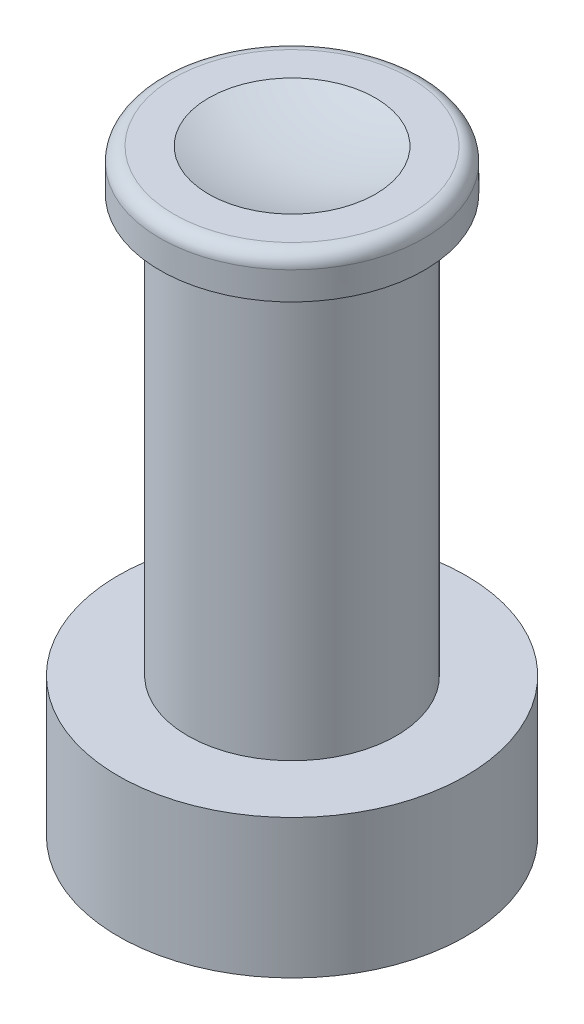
ISO-10303-21;
HEADER;
FILE_DESCRIPTION(('STEP AP214'),'2;1');
FILE_NAME('part.step','',(''),(''),'','','');
FILE_SCHEMA(('AUTOMOTIVE_DESIGN { 1 0 10303 214 1 1 1 1 }'));
ENDSEC;
DATA;
#1=APPLICATION_CONTEXT('core data for automotive mechanical design processes');
#2=APPLICATION_PROTOCOL_DEFINITION('international standard','automotive_design',2000,#1);
#3=PRODUCT_CONTEXT('',#1,'mechanical');
#4=PRODUCT('Part','Part','',(#3));
#5=PRODUCT_RELATED_PRODUCT_CATEGORY('part','',(#4));
#6=PRODUCT_DEFINITION_FORMATION('','',#4);
#7=PRODUCT_DEFINITION_CONTEXT('part definition',#1,'design');
#8=PRODUCT_DEFINITION('design','',#6,#7);
#9=PRODUCT_DEFINITION_SHAPE('','',#8);
#10=(LENGTH_UNIT() NAMED_UNIT(*) SI_UNIT(.MILLI.,.METRE.));
#11=(NAMED_UNIT(*) PLANE_ANGLE_UNIT() SI_UNIT($,.RADIAN.));
#12=(NAMED_UNIT(*) SI_UNIT($,.STERADIAN.) SOLID_ANGLE_UNIT());
#13=UNCERTAINTY_MEASURE_WITH_UNIT(LENGTH_MEASURE(1.E-05),#10,'distance_accuracy_value','');
#14=(GEOMETRIC_REPRESENTATION_CONTEXT(3) GLOBAL_UNCERTAINTY_ASSIGNED_CONTEXT((#13)) GLOBAL_UNIT_ASSIGNED_CONTEXT((#10,
#11,#12)) REPRESENTATION_CONTEXT('',''));
#15=CARTESIAN_POINT('',(0.,0.,0.));
#16=DIRECTION('',(0.,0.,1.));
#17=DIRECTION('',(1.,0.,0.));
#18=AXIS2_PLACEMENT_3D('',#15,#16,#17);
#19=CARTESIAN_POINT('',(0.,-7.62,0.));
#20=DIRECTION('',(0.,1.,0.));
#21=DIRECTION('',(0.,0.,1.));
#22=AXIS2_PLACEMENT_3D('',#19,#20,#21);
#23=CYLINDRICAL_SURFACE('',#22,1.905);
#24=CARTESIAN_POINT('',(0.,-7.62,0.));
#25=DIRECTION('',(0.,-1.,0.));
#26=DIRECTION('',(0.,0.,-1.));
#27=AXIS2_PLACEMENT_3D('',#24,#25,#26);
#28=CIRCLE('',#27,1.905);
#29=CARTESIAN_POINT('',(0.,-7.62,1.905));
#30=VERTEX_POINT('',#29);
#31=EDGE_CURVE('E51',#30,#30,#28,.F.);
#32=CARTESIAN_POINT('',(0.,0.,0.));
#33=DIRECTION('',(0.,1.,0.));
#34=DIRECTION('',(0.,0.,1.));
#35=AXIS2_PLACEMENT_3D('',#32,#33,#34);
#36=CIRCLE('',#35,1.905);
#37=CARTESIAN_POINT('',(0.,0.,1.905));
#38=VERTEX_POINT('',#37);
#39=EDGE_CURVE('E42',#38,#38,#36,.T.);
#40=CARTESIAN_POINT('',(0.,-7.62,1.905));
#41=CARTESIAN_POINT('',(0.,-7.540625,1.905));
#42=CARTESIAN_POINT('',(0.,-7.46125,1.905));
#43=CARTESIAN_POINT('',(0.,-7.3025,1.905));
#44=CARTESIAN_POINT('',(0.,-7.223125,1.905));
#45=CARTESIAN_POINT('',(0.,-7.064375,1.905));
#46=CARTESIAN_POINT('',(0.,-6.985,1.905));
#47=CARTESIAN_POINT('',(0.,-6.82625,1.905));
#48=CARTESIAN_POINT('',(0.,-6.746875,1.905));
#49=CARTESIAN_POINT('',(0.,-6.588125,1.905));
#50=CARTESIAN_POINT('',(0.,-6.50875,1.905));
#51=CARTESIAN_POINT('',(0.,-6.35,1.905));
#52=CARTESIAN_POINT('',(0.,-6.270625,1.905));
#53=CARTESIAN_POINT('',(0.,-6.111875,1.905));
#54=CARTESIAN_POINT('',(0.,-6.0325,1.905));
#55=CARTESIAN_POINT('',(0.,-5.87375,1.905));
#56=CARTESIAN_POINT('',(0.,-5.794375,1.905));
#57=CARTESIAN_POINT('',(0.,-5.635625,1.905));
#58=CARTESIAN_POINT('',(0.,-5.55625,1.905));
#59=CARTESIAN_POINT('',(0.,-5.3975,1.905));
#60=CARTESIAN_POINT('',(0.,-5.318125,1.905));
#61=CARTESIAN_POINT('',(0.,-5.159375,1.905));
#62=CARTESIAN_POINT('',(0.,-5.08,1.905));
#63=CARTESIAN_POINT('',(0.,-4.92125,1.905));
#64=CARTESIAN_POINT('',(0.,-4.841875,1.905));
#65=CARTESIAN_POINT('',(0.,-4.683125,1.905));
#66=CARTESIAN_POINT('',(0.,-4.60375,1.905));
#67=CARTESIAN_POINT('',(0.,-4.445,1.905));
#68=CARTESIAN_POINT('',(0.,-4.365625,1.905));
#69=CARTESIAN_POINT('',(0.,-4.206875,1.905));
#70=CARTESIAN_POINT('',(0.,-4.1275,1.905));
#71=CARTESIAN_POINT('',(0.,-3.96875,1.905));
#72=CARTESIAN_POINT('',(0.,-3.889375,1.905));
#73=CARTESIAN_POINT('',(0.,-3.730625,1.905));
#74=CARTESIAN_POINT('',(0.,-3.65125,1.905));
#75=CARTESIAN_POINT('',(0.,-3.4925,1.905));
#76=CARTESIAN_POINT('',(0.,-3.413125,1.905));
#77=CARTESIAN_POINT('',(0.,-3.254375,1.905));
#78=CARTESIAN_POINT('',(0.,-3.175,1.905));
#79=CARTESIAN_POINT('',(0.,-3.01625,1.905));
#80=CARTESIAN_POINT('',(0.,-2.936875,1.905));
#81=CARTESIAN_POINT('',(0.,-2.778125,1.905));
#82=CARTESIAN_POINT('',(0.,-2.69875,1.905));
#83=CARTESIAN_POINT('',(0.,-2.54,1.905));
#84=CARTESIAN_POINT('',(0.,-2.460625,1.905));
#85=CARTESIAN_POINT('',(0.,-2.301875,1.905));
#86=CARTESIAN_POINT('',(0.,-2.2225,1.905));
#87=CARTESIAN_POINT('',(0.,-2.06375,1.905));
#88=CARTESIAN_POINT('',(0.,-1.984375,1.905));
#89=CARTESIAN_POINT('',(0.,-1.825625,1.905));
#90=CARTESIAN_POINT('',(0.,-1.74625,1.905));
#91=CARTESIAN_POINT('',(0.,-1.5875,1.905));
#92=CARTESIAN_POINT('',(0.,-1.508125,1.905));
#93=CARTESIAN_POINT('',(0.,-1.349375,1.905));
#94=CARTESIAN_POINT('',(0.,-1.27,1.905));
#95=CARTESIAN_POINT('',(0.,-1.11125,1.905));
#96=CARTESIAN_POINT('',(0.,-1.031875,1.905));
#97=CARTESIAN_POINT('',(0.,-0.873125,1.905));
#98=CARTESIAN_POINT('',(0.,-0.79375,1.905));
#99=CARTESIAN_POINT('',(0.,-0.635,1.905));
#100=CARTESIAN_POINT('',(0.,-0.555625,1.905));
#101=CARTESIAN_POINT('',(0.,-0.396875,1.905));
#102=CARTESIAN_POINT('',(0.,-0.3175,1.905));
#103=CARTESIAN_POINT('',(0.,-0.15875,1.905));
#104=CARTESIAN_POINT('',(0.,-0.0793749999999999,1.905));
#105=CARTESIAN_POINT('',(0.,0.,1.905));
#106=B_SPLINE_CURVE_WITH_KNOTS('',3,(#40,#41,#42,#43,#44,#45,#46,#47,#48,#49,#50,#51,#52,#53,
#54,#55,#56,#57,#58,#59,#60,#61,#62,#63,#64,#65,#66,#67,#68,#69,#70,#71,#72,#73,#74,#75,#76,#77,
#78,#79,#80,#81,#82,#83,#84,#85,#86,#87,#88,#89,#90,#91,#92,#93,#94,#95,#96,#97,#98,#99,#100,
#101,#102,#103,#104,#105),.UNSPECIFIED.,.F.,.F.,(4,2,2,2,2,2,2,2,2,2,2,2,2,2,2,2,2,2,2,2,2,2,2,
2,2,2,2,2,2,2,2,2,4),(0.,0.238125,0.47625,0.714375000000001,0.9525,1.190625,1.42875,1.666875,
1.905,2.143125,2.38125,2.619375,2.8575,3.095625,3.33375,3.571875,3.81,4.048125,4.28625,4.524375,
4.7625,5.000625,5.23875,5.476875,5.715,5.953125,6.19125,6.429375,6.6675,6.905625,7.14375,
7.381875,7.62),.UNSPECIFIED.);
#107=EDGE_CURVE('BSEAM32',#30,#38,#106,.T.);
#108=ORIENTED_EDGE('',*,*,#31,.T.);
#109=ORIENTED_EDGE('',*,*,#39,.F.);
#110=ORIENTED_EDGE('',*,*,#107,.T.);
#111=ORIENTED_EDGE('',*,*,#107,.F.);
#112=EDGE_LOOP('',(#108,#110,#109,#111));
#113=FACE_BOUND('',#112,.T.);
#114=ADVANCED_FACE('F32',(#113),#23,.T.);
#115=CARTESIAN_POINT('',(0.,0.762,0.));
#116=DIRECTION('',(0.,-1.,0.));
#117=DIRECTION('',(0.,0.,-1.));
#118=AXIS2_PLACEMENT_3D('',#115,#116,#117);
#119=CYLINDRICAL_SURFACE('',#118,2.413);
#120=CARTESIAN_POINT('',(0.,0.508,0.));
#121=DIRECTION('',(0.,1.,0.));
#122=DIRECTION('',(0.,0.,1.));
#123=AXIS2_PLACEMENT_3D('',#120,#121,#122);
#124=CIRCLE('',#123,2.413);
#125=CARTESIAN_POINT('',(0.,0.508,-2.413));
#126=VERTEX_POINT('',#125);
#127=EDGE_CURVE('E10',#126,#126,#124,.F.);
#128=CARTESIAN_POINT('',(0.,0.,0.));
#129=DIRECTION('',(0.,1.,0.));
#130=DIRECTION('',(0.,0.,1.));
#131=AXIS2_PLACEMENT_3D('',#128,#129,#130);
#132=CIRCLE('',#131,2.413);
#133=CARTESIAN_POINT('',(0.,0.,-2.413));
#134=VERTEX_POINT('',#133);
#135=EDGE_CURVE('E46',#134,#134,#132,.T.);
#136=CARTESIAN_POINT('',(0.,0.508,-2.413));
#137=CARTESIAN_POINT('',(0.,0.502708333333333,-2.413));
#138=CARTESIAN_POINT('',(0.,0.497416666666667,-2.413));
#139=CARTESIAN_POINT('',(0.,0.486833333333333,-2.413));
#140=CARTESIAN_POINT('',(0.,0.481541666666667,-2.413));
#141=CARTESIAN_POINT('',(0.,0.470958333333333,-2.413));
#142=CARTESIAN_POINT('',(0.,0.465666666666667,-2.413));
#143=CARTESIAN_POINT('',(0.,0.455083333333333,-2.413));
#144=CARTESIAN_POINT('',(0.,0.449791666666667,-2.413));
#145=CARTESIAN_POINT('',(0.,0.439208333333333,-2.413));
#146=CARTESIAN_POINT('',(0.,0.433916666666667,-2.413));
#147=CARTESIAN_POINT('',(0.,0.423333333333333,-2.413));
#148=CARTESIAN_POINT('',(0.,0.418041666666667,-2.413));
#149=CARTESIAN_POINT('',(0.,0.407458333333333,-2.413));
#150=CARTESIAN_POINT('',(0.,0.402166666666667,-2.413));
#151=CARTESIAN_POINT('',(0.,0.391583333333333,-2.413));
#152=CARTESIAN_POINT('',(0.,0.386291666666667,-2.413));
#153=CARTESIAN_POINT('',(0.,0.375708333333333,-2.413));
#154=CARTESIAN_POINT('',(0.,0.370416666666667,-2.413));
#155=CARTESIAN_POINT('',(0.,0.359833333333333,-2.413));
#156=CARTESIAN_POINT('',(0.,0.354541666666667,-2.413));
#157=CARTESIAN_POINT('',(0.,0.343958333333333,-2.413));
#158=CARTESIAN_POINT('',(0.,0.338666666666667,-2.413));
#159=CARTESIAN_POINT('',(0.,0.328083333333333,-2.413));
#160=CARTESIAN_POINT('',(0.,0.322791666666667,-2.413));
#161=CARTESIAN_POINT('',(0.,0.312208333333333,-2.413));
#162=CARTESIAN_POINT('',(0.,0.306916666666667,-2.413));
#163=CARTESIAN_POINT('',(0.,0.296333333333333,-2.413));
#164=CARTESIAN_POINT('',(0.,0.291041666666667,-2.413));
#165=CARTESIAN_POINT('',(0.,0.280458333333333,-2.413));
#166=CARTESIAN_POINT('',(0.,0.275166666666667,-2.413));
#167=CARTESIAN_POINT('',(0.,0.264583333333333,-2.413));
#168=CARTESIAN_POINT('',(0.,0.259291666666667,-2.413));
#169=CARTESIAN_POINT('',(0.,0.248708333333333,-2.413));
#170=CARTESIAN_POINT('',(0.,0.243416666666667,-2.413));
#171=CARTESIAN_POINT('',(0.,0.232833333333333,-2.413));
#172=CARTESIAN_POINT('',(0.,0.227541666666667,-2.413));
#173=CARTESIAN_POINT('',(0.,0.216958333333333,-2.413));
#174=CARTESIAN_POINT('',(0.,0.211666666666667,-2.413));
#175=CARTESIAN_POINT('',(0.,0.201083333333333,-2.413));
#176=CARTESIAN_POINT('',(0.,0.195791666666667,-2.413));
#177=CARTESIAN_POINT('',(0.,0.185208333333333,-2.413));
#178=CARTESIAN_POINT('',(0.,0.179916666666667,-2.413));
#179=CARTESIAN_POINT('',(0.,0.169333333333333,-2.413));
#180=CARTESIAN_POINT('',(0.,0.164041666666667,-2.413));
#181=CARTESIAN_POINT('',(0.,0.153458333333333,-2.413));
#182=CARTESIAN_POINT('',(0.,0.148166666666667,-2.413));
#183=CARTESIAN_POINT('',(0.,0.137583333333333,-2.413));
#184=CARTESIAN_POINT('',(0.,0.132291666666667,-2.413));
#185=CARTESIAN_POINT('',(0.,0.121708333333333,-2.413));
#186=CARTESIAN_POINT('',(0.,0.116416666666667,-2.413));
#187=CARTESIAN_POINT('',(0.,0.105833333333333,-2.413));
#188=CARTESIAN_POINT('',(0.,0.100541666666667,-2.413));
#189=CARTESIAN_POINT('',(0.,0.0899583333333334,-2.413));
#190=CARTESIAN_POINT('',(0.,0.0846666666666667,-2.413));
#191=CARTESIAN_POINT('',(0.,0.0740833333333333,-2.413));
#192=CARTESIAN_POINT('',(0.,0.0687916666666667,-2.413));
#193=CARTESIAN_POINT('',(0.,0.0582083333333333,-2.413));
#194=CARTESIAN_POINT('',(0.,0.0529166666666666,-2.413));
#195=CARTESIAN_POINT('',(0.,0.0423333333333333,-2.413));
#196=CARTESIAN_POINT('',(0.,0.0370416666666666,-2.413));
#197=CARTESIAN_POINT('',(0.,0.0264583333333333,-2.413));
#198=CARTESIAN_POINT('',(0.,0.0211666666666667,-2.413));
#199=CARTESIAN_POINT('',(0.,0.0105833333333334,-2.413));
#200=CARTESIAN_POINT('',(0.,0.00529166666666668,-2.413));
#201=CARTESIAN_POINT('',(0.,0.,-2.413));
#202=B_SPLINE_CURVE_WITH_KNOTS('',3,(#136,#137,#138,#139,#140,#141,#142,#143,#144,#145,#146,
#147,#148,#149,#150,#151,#152,#153,#154,#155,#156,#157,#158,#159,#160,#161,#162,#163,#164,#165,
#166,#167,#168,#169,#170,#171,#172,#173,#174,#175,#176,#177,#178,#179,#180,#181,#182,#183,#184,
#185,#186,#187,#188,#189,#190,#191,#192,#193,#194,#195,#196,#197,#198,#199,#200,#201),
.UNSPECIFIED.,.F.,.F.,(4,2,2,2,2,2,2,2,2,2,2,2,2,2,2,2,2,2,2,2,2,2,2,2,2,2,2,2,2,2,2,2,4),(0.,
0.015875,0.03175,0.047625,0.0635,0.0793750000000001,0.0952500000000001,0.111125,0.127,0.142875,
0.15875,0.174625,0.1905,0.206375,0.22225,0.238125,0.254,0.269875,0.28575,0.301625,0.3175,
0.333375,0.34925,0.365125,0.381,0.396875,0.41275,0.428625,0.4445,0.460375,0.47625,0.492125,
0.508),.UNSPECIFIED.);
#203=EDGE_CURVE('BSEAM78',#126,#134,#202,.T.);
#204=ORIENTED_EDGE('',*,*,#127,.T.);
#205=ORIENTED_EDGE('',*,*,#135,.T.);
#206=ORIENTED_EDGE('',*,*,#203,.T.);
#207=ORIENTED_EDGE('',*,*,#203,.F.);
#208=EDGE_LOOP('',(#204,#206,#205,#207));
#209=FACE_BOUND('',#208,.T.);
#210=ADVANCED_FACE('F78',(#209),#119,.T.);
#211=CARTESIAN_POINT('',(0.,0.762,0.));
#212=DIRECTION('',(0.,1.,0.));
#213=DIRECTION('',(0.,0.,1.));
#214=AXIS2_PLACEMENT_3D('',#211,#212,#213);
#215=PLANE('',#214);
#216=CARTESIAN_POINT('',(0.,0.762,0.));
#217=DIRECTION('',(0.,-1.,0.));
#218=DIRECTION('',(0.,0.,-1.));
#219=AXIS2_PLACEMENT_3D('',#216,#217,#218);
#220=CIRCLE('',#219,1.524);
#221=CARTESIAN_POINT('',(0.,0.762,-1.524));
#222=VERTEX_POINT('',#221);
#223=EDGE_CURVE('E60',#222,#222,#220,.T.);
#224=ORIENTED_EDGE('',*,*,#223,.T.);
#225=EDGE_LOOP('',(#224));
#226=FACE_BOUND('',#225,.T.);
#227=CARTESIAN_POINT('',(0.,0.762,0.));
#228=DIRECTION('',(0.,1.,0.));
#229=DIRECTION('',(0.,0.,1.));
#230=AXIS2_PLACEMENT_3D('',#227,#228,#229);
#231=CIRCLE('',#230,2.159);
#232=CARTESIAN_POINT('',(0.,0.762,2.159));
#233=VERTEX_POINT('',#232);
#234=EDGE_CURVE('E38',#233,#233,#231,.T.);
#235=ORIENTED_EDGE('',*,*,#234,.T.);
#236=EDGE_LOOP('',(#235));
#237=FACE_BOUND('',#236,.T.);
#238=ADVANCED_FACE('F64',(#226,#237),#215,.T.);
#239=CARTESIAN_POINT('',(0.,0.,0.));
#240=DIRECTION('',(0.,1.,0.));
#241=DIRECTION('',(0.,0.,1.));
#242=AXIS2_PLACEMENT_3D('',#239,#240,#241);
#243=PLANE('',#242);
#244=ORIENTED_EDGE('',*,*,#39,.T.);
#245=EDGE_LOOP('',(#244));
#246=FACE_BOUND('',#245,.T.);
#247=ORIENTED_EDGE('',*,*,#135,.F.);
#248=EDGE_LOOP('',(#247));
#249=FACE_BOUND('',#248,.T.);
#250=ADVANCED_FACE('F88',(#246,#249),#243,.F.);
#251=CARTESIAN_POINT('',(0.,-10.16,0.));
#252=DIRECTION('',(0.,1.,0.));
#253=DIRECTION('',(0.,0.,1.));
#254=AXIS2_PLACEMENT_3D('',#251,#252,#253);
#255=CYLINDRICAL_SURFACE('',#254,3.175);
#256=CARTESIAN_POINT('',(0.,-10.16,0.));
#257=DIRECTION('',(0.,-1.,0.));
#258=DIRECTION('',(0.,0.,-1.));
#259=AXIS2_PLACEMENT_3D('',#256,#257,#258);
#260=CIRCLE('',#259,3.175);
#261=CARTESIAN_POINT('',(0.,-10.16,-3.175));
#262=VERTEX_POINT('',#261);
#263=EDGE_CURVE('E54',#262,#262,#260,.T.);
#264=ORIENTED_EDGE('',*,*,#263,.F.);
#265=EDGE_LOOP('',(#264));
#266=FACE_BOUND('',#265,.T.);
#267=CARTESIAN_POINT('',(0.,-7.62,0.));
#268=DIRECTION('',(0.,-1.,0.));
#269=DIRECTION('',(0.,0.,-1.));
#270=AXIS2_PLACEMENT_3D('',#267,#268,#269);
#271=CIRCLE('',#270,3.175);
#272=CARTESIAN_POINT('',(0.,-7.62,-3.175));
#273=VERTEX_POINT('',#272);
#274=EDGE_CURVE('E57',#273,#273,#271,.T.);
#275=ORIENTED_EDGE('',*,*,#274,.T.);
#276=EDGE_LOOP('',(#275));
#277=FACE_BOUND('',#276,.T.);
#278=ADVANCED_FACE('F90',(#266,#277),#255,.T.);
#279=CARTESIAN_POINT('',(0.,-10.16,0.));
#280=DIRECTION('',(0.,-1.,0.));
#281=DIRECTION('',(0.,0.,-1.));
#282=AXIS2_PLACEMENT_3D('',#279,#280,#281);
#283=PLANE('',#282);
#284=ORIENTED_EDGE('',*,*,#263,.T.);
#285=EDGE_LOOP('',(#284));
#286=FACE_BOUND('',#285,.T.);
#287=ADVANCED_FACE('F97',(#286),#283,.T.);
#288=CARTESIAN_POINT('',(0.,-7.62,0.));
#289=DIRECTION('',(0.,-1.,0.));
#290=DIRECTION('',(0.,0.,-1.));
#291=AXIS2_PLACEMENT_3D('',#288,#289,#290);
#292=PLANE('',#291);
#293=ORIENTED_EDGE('',*,*,#31,.F.);
#294=EDGE_LOOP('',(#293));
#295=FACE_BOUND('',#294,.T.);
#296=ORIENTED_EDGE('',*,*,#274,.F.);
#297=EDGE_LOOP('',(#296));
#298=FACE_BOUND('',#297,.T.);
#299=ADVANCED_FACE('F74',(#295,#298),#292,.F.);
#300=CARTESIAN_POINT('',(0.,0.508,0.));
#301=DIRECTION('',(0.,1.,0.));
#302=DIRECTION('',(0.,0.,1.));
#303=AXIS2_PLACEMENT_3D('',#300,#301,#302);
#304=TOROIDAL_SURFACE('',#303,2.159,0.254);
#305=ORIENTED_EDGE('',*,*,#127,.F.);
#306=EDGE_LOOP('',(#305));
#307=FACE_BOUND('',#306,.T.);
#308=ORIENTED_EDGE('',*,*,#234,.F.);
#309=EDGE_LOOP('',(#308));
#310=FACE_BOUND('',#309,.T.);
#311=ADVANCED_FACE('F68',(#307,#310),#304,.T.);
#312=CARTESIAN_POINT('',(0.,5.207,0.));
#313=DIRECTION('',(0.,-1.,0.));
#314=DIRECTION('',(1.,0.,0.));
#315=AXIS2_PLACEMENT_3D('',#312,#313,#314);
#316=SPHERICAL_SURFACE('',#315,4.699);
#317=ORIENTED_EDGE('',*,*,#223,.F.);
#318=EDGE_LOOP('',(#317));
#319=FACE_BOUND('',#318,.T.);
#320=ADVANCED_FACE('F66',(#319),#316,.F.);
#321=CLOSED_SHELL('',(#114,#210,#238,#250,#278,#287,#299,#311,#320));
#322=MANIFOLD_SOLID_BREP('B2',#321);
#323=ADVANCED_BREP_SHAPE_REPRESENTATION('',(#18,#322),#14);
#324=SHAPE_DEFINITION_REPRESENTATION(#9,#323);
ENDSEC;
END-ISO-10303-21;
